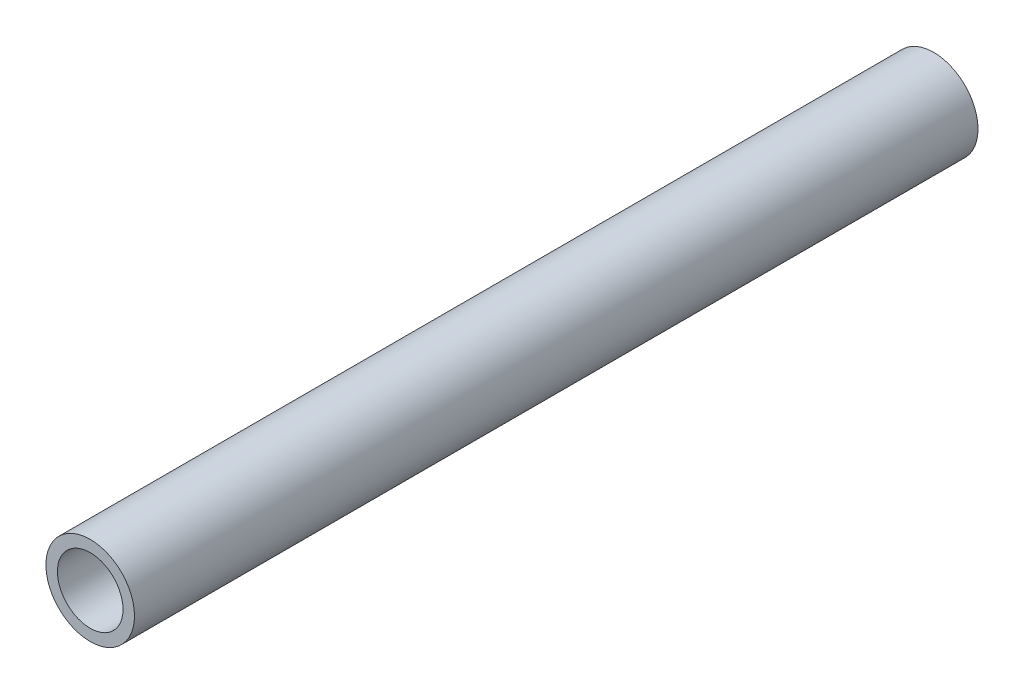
from build123d import *

# Parameters (mm, degrees)
SKETCH1_R           = 10.668
SKETCH1_R_2         = 7.8994
BOSS_EXTRUDE1_DEPTH = 101.6
SKETCH2_R           = 3.175
CUT_EXTRUDE1_DEPTH  = 25.4


with BuildPart() as part:
    # Sketch1 → Boss-Extrude1 (new, symmetric)
    with BuildSketch(Plane.XY):
        Circle(SKETCH1_R)
        Circle(SKETCH1_R_2, mode=Mode.SUBTRACT)
    extrude(amount=BOSS_EXTRUDE1_DEPTH, both=True)

    # Sketch2 → Cut-Extrude1 (cut)
    with BuildSketch(Plane(origin=(0, 0, 0), x_dir=(1, 0, 0), z_dir=(0, 1, 0))):
        with Locations(Location((0, -69.85, 0), (0, 0, 270))):
            Circle(SKETCH2_R)
        with Locations(Location((0, -57.7342, 0), (0, 0, 270))):
            Circle(SKETCH2_R)
        with Locations(Location((0, -45.6184, 0), (0, 0, 270))):
            Circle(SKETCH2_R)
        with Locations(Location((0, -33.5026, 0), (0, 0, 270))):
            Circle(SKETCH2_R)
        with Locations(Location((0, -21.3868, 0), (0, 0, 270))):
            Circle(SKETCH2_R)
        with Locations(Location((0, -9.271, 0), (0, 0, 270))):
            Circle(SKETCH2_R)
        with Locations(Location((0, 2.8448, 0), (0, 0, 270))):
            Circle(SKETCH2_R)
        with Locations(Location((0, 14.9606, 0), (0, 0, 270))):
            Circle(SKETCH2_R)
        with Locations(Location((0, 27.0764, 0), (0, 0, 270))):
            Circle(SKETCH2_R)
        with Locations(Location((0, 39.1922, 0), (0, 0, 270))):
            Circle(SKETCH2_R)
        with Locations(Location((0, 51.308, 0), (0, 0, 270))):
            Circle(SKETCH2_R)
        with Locations(Location((0, 63.4238, 0), (0, 0, 270))):
            Circle(SKETCH2_R)
    extrude(amount=-CUT_EXTRUDE1_DEPTH, mode=Mode.SUBTRACT)


solid = part.part
